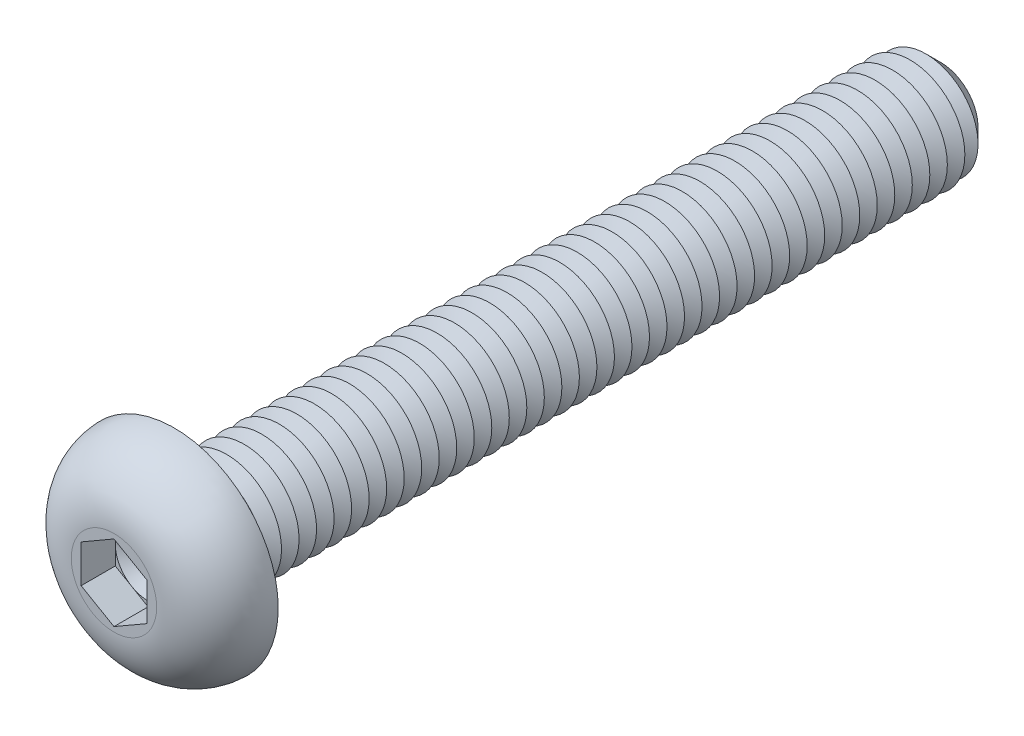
from build123d import *

# Parameters (mm, degrees)
CUT_EXTRUDE1_DEPTH  = 1.56
SKETCH4_R           = 2.5
BOSS_EXTRUDE1_DEPTH = 35
CHAMFER1_SIZE       = 0.8
LPATTERN1_COUNT     = 42
LPATTERN1_PITCH     = 0.8
FILLET2_R           = 0.4


with BuildPart() as part:
    # Sketch2 → Revolve1 (revolve)
    with BuildSketch(Plane(origin=(0, 0, 0), x_dir=(0, 0, -1), z_dir=(1, 0, 0)), mode=Mode.PRIVATE) as revolve1_sk:
        with BuildLine():
            Line((0, 0), (-2.75, 0))
            Line((-2.75, 0), (-2.75, 1.950446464))
            ThreePointArc((-2.75, 1.950446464), (-1.947498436, 3.912588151), (0, 4.75))
            Line((0, 4.75), (0, 0))
        make_face()
    revolve(revolve1_sk.sketch.rotate(Axis((0, 0, 47.934239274), (0, 0, -1)), 90), axis=Axis((0, 0, 47.934239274), (0, 0, -1)))

    # Sketch3 → Cut-Extrude1 (cut)
    with BuildSketch(Plane.XY.offset(2.75)):
        Polygon((0, 1.732050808), (-1.5, 0.866025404), (-1.5, -0.866025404), (0, -1.732050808), (1.5, -0.866025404), (1.5, 0.866025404), align=None)
    extrude(amount=-CUT_EXTRUDE1_DEPTH, mode=Mode.SUBTRACT)

    # Sketch4 → Boss-Extrude1 (add)
    with BuildSketch(Plane(origin=(0, 0, 0), x_dir=(-1, 0, 0), z_dir=(0, 0, -1))):
        with Locations(Location((0, 0, 0), (0, 0, 180))):
            Circle(SKETCH4_R)
    extrude(amount=BOSS_EXTRUDE1_DEPTH)

    # Chamfer1
    chamfer1_edges = [part.edges().sort_by_distance(p)[0] for p in [
        (-2.5, 0, -35),
    ]]
    chamfer(chamfer1_edges, length=CHAMFER1_SIZE)

    # Sketch5 → Cut-Revolve1 (revolve, cut)
    with BuildSketch(Plane(origin=(0, 0, 0), x_dir=(0, 0, -1), z_dir=(1, 0, 0)), mode=Mode.PRIVATE) as cut_revolve1_sk:
        Polygon((0.8, 2.5), (1.6, 2.5), (1.2, 1.807179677), align=None)
    cut_revolve1 = revolve(cut_revolve1_sk.sketch.rotate(Axis((0, 0, 47.934239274), (0, 0, -1)), 90), axis=Axis((0, 0, 47.934239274), (0, 0, -1)), mode=Mode.SUBTRACT)

    # LPattern1: Cut-Revolve1 ×42
    with Locations(*[(0, 0, -i * LPATTERN1_PITCH) for i in range(1, LPATTERN1_COUNT)]):
        add(cut_revolve1, mode=Mode.SUBTRACT)

    # Fillet2
    fillet2_edges = [part.edges().sort_by_distance(p)[0] for p in [
        (-2.5, 0, 0),
    ]]
    fillet(fillet2_edges, radius=FILLET2_R)

    # Cut-Extrude2 cone 1 section (on through the dimple's axis) → Cut-Extrude2 (revolve, cut)
    with BuildSketch(Plane(origin=(0, 0, 1.19), x_dir=(0, -1, 0), z_dir=(1, 0, 0))):
        Polygon((0, 0), (1.5, 0), (0, 0.866025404), align=None)
    revolve(axis=Axis((0, 0, 1.19), (0, 0, -1)), mode=Mode.SUBTRACT)


solid = part.part
